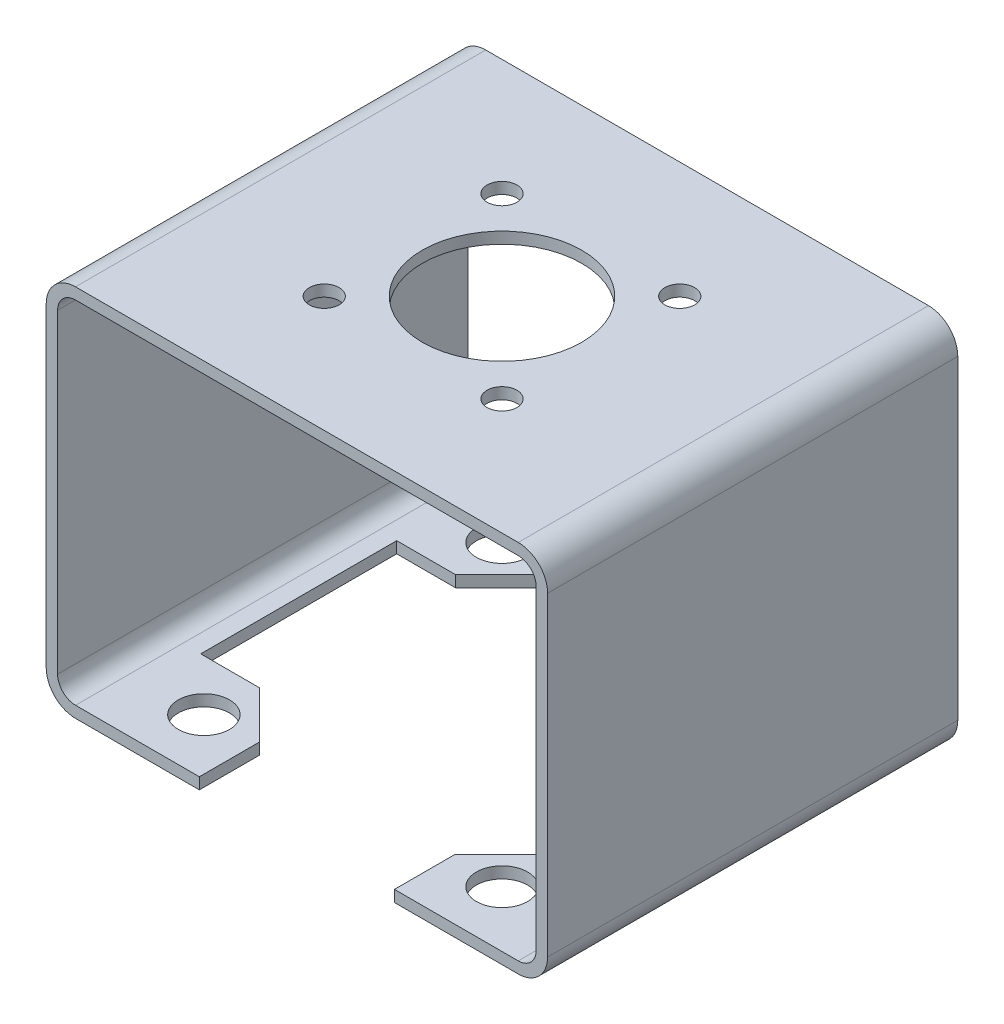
ISO-10303-21;
HEADER;
FILE_DESCRIPTION(('STEP AP214'),'2;1');
FILE_NAME('part.step','',(''),(''),'','','');
FILE_SCHEMA(('AUTOMOTIVE_DESIGN { 1 0 10303 214 1 1 1 1 }'));
ENDSEC;
DATA;
#1=APPLICATION_CONTEXT('core data for automotive mechanical design processes');
#2=APPLICATION_PROTOCOL_DEFINITION('international standard','automotive_design',2000,#1);
#3=PRODUCT_CONTEXT('',#1,'mechanical');
#4=PRODUCT('Part','Part','',(#3));
#5=PRODUCT_RELATED_PRODUCT_CATEGORY('part','',(#4));
#6=PRODUCT_DEFINITION_FORMATION('','',#4);
#7=PRODUCT_DEFINITION_CONTEXT('part definition',#1,'design');
#8=PRODUCT_DEFINITION('design','',#6,#7);
#9=PRODUCT_DEFINITION_SHAPE('','',#8);
#10=(LENGTH_UNIT() NAMED_UNIT(*) SI_UNIT(.MILLI.,.METRE.));
#11=(NAMED_UNIT(*) PLANE_ANGLE_UNIT() SI_UNIT($,.RADIAN.));
#12=(NAMED_UNIT(*) SI_UNIT($,.STERADIAN.) SOLID_ANGLE_UNIT());
#13=UNCERTAINTY_MEASURE_WITH_UNIT(LENGTH_MEASURE(1.E-05),#10,'distance_accuracy_value','');
#14=(GEOMETRIC_REPRESENTATION_CONTEXT(3) GLOBAL_UNCERTAINTY_ASSIGNED_CONTEXT((#13)) GLOBAL_UNIT_ASSIGNED_CONTEXT((#10,
#11,#12)) REPRESENTATION_CONTEXT('',''));
#15=CARTESIAN_POINT('',(0.,0.,0.));
#16=DIRECTION('',(0.,0.,1.));
#17=DIRECTION('',(1.,0.,0.));
#18=AXIS2_PLACEMENT_3D('',#15,#16,#17);
#19=CARTESIAN_POINT('',(27.178,0.,114.3));
#20=DIRECTION('',(-1.,0.,0.));
#21=DIRECTION('',(0.,0.,1.));
#22=AXIS2_PLACEMENT_3D('',#19,#20,#21);
#23=PLANE('',#22);
#24=DIRECTION('',(0.,-1.,0.));
#25=VECTOR('',#24,1.);
#26=CARTESIAN_POINT('',(27.178,104.141,16.764));
#27=LINE('',#26,#25);
#28=CARTESIAN_POINT('',(27.178,3.17500000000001,16.764));
#29=VERTEX_POINT('',#28);
#30=CARTESIAN_POINT('',(27.178,0.,16.764));
#31=VERTEX_POINT('',#30);
#32=EDGE_CURVE('E259',#29,#31,#27,.T.);
#33=ORIENTED_EDGE('',*,*,#32,.F.);
#34=DIRECTION('',(0.,0.,-1.));
#35=VECTOR('',#34,1.);
#36=CARTESIAN_POINT('',(27.178,3.17500000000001,114.3));
#37=LINE('',#36,#35);
#38=CARTESIAN_POINT('',(27.178,3.17500000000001,0.));
#39=VERTEX_POINT('',#38);
#40=EDGE_CURVE('E266',#29,#39,#37,.T.);
#41=ORIENTED_EDGE('',*,*,#40,.T.);
#42=DIRECTION('',(0.,1.,0.));
#43=VECTOR('',#42,1.);
#44=CARTESIAN_POINT('',(27.178,0.,0.));
#45=LINE('',#44,#43);
#46=CARTESIAN_POINT('',(27.178,0.,0.));
#47=VERTEX_POINT('',#46);
#48=EDGE_CURVE('E342',#47,#39,#45,.T.);
#49=ORIENTED_EDGE('',*,*,#48,.F.);
#50=DIRECTION('',(0.,0.,-1.));
#51=VECTOR('',#50,1.);
#52=CARTESIAN_POINT('',(27.178,0.,114.3));
#53=LINE('',#52,#51);
#54=EDGE_CURVE('E385',#31,#47,#53,.T.);
#55=ORIENTED_EDGE('',*,*,#54,.F.);
#56=EDGE_LOOP('',(#33,#41,#49,#55));
#57=FACE_BOUND('',#56,.T.);
#58=ADVANCED_FACE('F30',(#57),#23,.T.);
#59=CARTESIAN_POINT('',(-27.178,3.175,114.3));
#60=DIRECTION('',(1.,0.,0.));
#61=DIRECTION('',(0.,0.,-1.));
#62=AXIS2_PLACEMENT_3D('',#59,#60,#61);
#63=PLANE('',#62);
#64=DIRECTION('',(0.,-1.,0.));
#65=VECTOR('',#64,1.);
#66=CARTESIAN_POINT('',(-27.178,104.141,16.764));
#67=LINE('',#66,#65);
#68=CARTESIAN_POINT('',(-27.178,3.175,16.764));
#69=VERTEX_POINT('',#68);
#70=CARTESIAN_POINT('',(-27.178,0.,16.764));
#71=VERTEX_POINT('',#70);
#72=EDGE_CURVE('E507',#69,#71,#67,.T.);
#73=ORIENTED_EDGE('',*,*,#72,.T.);
#74=DIRECTION('',(0.,0.,-1.));
#75=VECTOR('',#74,1.);
#76=CARTESIAN_POINT('',(-27.178,0.,114.3));
#77=LINE('',#76,#75);
#78=CARTESIAN_POINT('',(-27.178,0.,0.));
#79=VERTEX_POINT('',#78);
#80=EDGE_CURVE('E38',#71,#79,#77,.T.);
#81=ORIENTED_EDGE('',*,*,#80,.T.);
#82=DIRECTION('',(0.,-1.,0.));
#83=VECTOR('',#82,1.);
#84=CARTESIAN_POINT('',(-27.178,3.175,0.));
#85=LINE('',#84,#83);
#86=CARTESIAN_POINT('',(-27.178,3.175,0.));
#87=VERTEX_POINT('',#86);
#88=EDGE_CURVE('E306',#87,#79,#85,.T.);
#89=ORIENTED_EDGE('',*,*,#88,.F.);
#90=DIRECTION('',(0.,0.,-1.));
#91=VECTOR('',#90,1.);
#92=CARTESIAN_POINT('',(-27.178,3.175,114.3));
#93=LINE('',#92,#91);
#94=EDGE_CURVE('E286',#69,#87,#93,.T.);
#95=ORIENTED_EDGE('',*,*,#94,.F.);
#96=EDGE_LOOP('',(#73,#81,#89,#95));
#97=FACE_BOUND('',#96,.T.);
#98=ADVANCED_FACE('F307',(#97),#63,.T.);
#99=CARTESIAN_POINT('',(-27.178,0.,114.3));
#100=DIRECTION('',(0.,1.,0.));
#101=DIRECTION('',(-1.,0.,0.));
#102=AXIS2_PLACEMENT_3D('',#99,#100,#101);
#103=PLANE('',#102);
#104=CARTESIAN_POINT('',(-41.529,0.,15.621));
#105=DIRECTION('',(0.,-1.,0.));
#106=DIRECTION('',(1.,0.,0.));
#107=AXIS2_PLACEMENT_3D('',#104,#105,#106);
#108=CIRCLE('',#107,7.1374);
#109=CARTESIAN_POINT('',(-34.3916,0.,15.621));
#110=VERTEX_POINT('',#109);
#111=EDGE_CURVE('E564',#110,#110,#108,.T.);
#112=ORIENTED_EDGE('',*,*,#111,.F.);
#113=EDGE_LOOP('',(#112));
#114=FACE_BOUND('',#113,.T.);
#115=CARTESIAN_POINT('',(-41.529,0.,98.679));
#116=DIRECTION('',(0.,-1.,0.));
#117=DIRECTION('',(1.,0.,0.));
#118=AXIS2_PLACEMENT_3D('',#115,#116,#117);
#119=CIRCLE('',#118,7.1374);
#120=CARTESIAN_POINT('',(-34.3916,0.,98.679));
#121=VERTEX_POINT('',#120);
#122=EDGE_CURVE('E420',#121,#121,#119,.T.);
#123=ORIENTED_EDGE('',*,*,#122,.F.);
#124=EDGE_LOOP('',(#123));
#125=FACE_BOUND('',#124,.T.);
#126=ORIENTED_EDGE('',*,*,#80,.F.);
#127=DIRECTION('',(0.707106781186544,0.,-0.707106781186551));
#128=VECTOR('',#127,1.);
#129=CARTESIAN_POINT('',(-27.178,0.,16.764));
#130=LINE('',#129,#128);
#131=CARTESIAN_POINT('',(-40.2589999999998,0.,29.845));
#132=VERTEX_POINT('',#131);
#133=EDGE_CURVE('E492',#132,#71,#130,.T.);
#134=ORIENTED_EDGE('',*,*,#133,.F.);
#135=DIRECTION('',(1.,0.,0.));
#136=VECTOR('',#135,1.);
#137=CARTESIAN_POINT('',(-56.642,0.,29.845));
#138=LINE('',#137,#136);
#139=CARTESIAN_POINT('',(-56.642,0.,29.845));
#140=VERTEX_POINT('',#139);
#141=EDGE_CURVE('E495',#140,#132,#138,.T.);
#142=ORIENTED_EDGE('',*,*,#141,.F.);
#143=DIRECTION('',(0.,0.,-1.));
#144=VECTOR('',#143,1.);
#145=CARTESIAN_POINT('',(-56.642,0.,84.455));
#146=LINE('',#145,#144);
#147=CARTESIAN_POINT('',(-56.642,0.,84.455));
#148=VERTEX_POINT('',#147);
#149=EDGE_CURVE('E498',#148,#140,#146,.T.);
#150=ORIENTED_EDGE('',*,*,#149,.F.);
#151=DIRECTION('',(-1.,0.,0.));
#152=VECTOR('',#151,1.);
#153=CARTESIAN_POINT('',(-40.259,0.,84.455));
#154=LINE('',#153,#152);
#155=CARTESIAN_POINT('',(-40.259,0.,84.455));
#156=VERTEX_POINT('',#155);
#157=EDGE_CURVE('E501',#156,#148,#154,.T.);
#158=ORIENTED_EDGE('',*,*,#157,.F.);
#159=DIRECTION('',(-0.707106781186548,0.,-0.707106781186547));
#160=VECTOR('',#159,1.);
#161=CARTESIAN_POINT('',(-27.178,0.,97.536));
#162=LINE('',#161,#160);
#163=CARTESIAN_POINT('',(-27.178,0.,97.536));
#164=VERTEX_POINT('',#163);
#165=EDGE_CURVE('E504',#164,#156,#162,.T.);
#166=ORIENTED_EDGE('',*,*,#165,.F.);
#167=CARTESIAN_POINT('',(-27.178,0.,114.3));
#168=VERTEX_POINT('',#167);
#169=EDGE_CURVE('E11',#168,#164,#77,.T.);
#170=ORIENTED_EDGE('',*,*,#169,.F.);
#171=DIRECTION('',(1.,0.,0.));
#172=VECTOR('',#171,1.);
#173=CARTESIAN_POINT('',(-27.178,0.,114.3));
#174=LINE('',#173,#172);
#175=CARTESIAN_POINT('',(-61.675,0.,114.3));
#176=VERTEX_POINT('',#175);
#177=EDGE_CURVE('E361',#176,#168,#174,.T.);
#178=ORIENTED_EDGE('',*,*,#177,.F.);
#179=DIRECTION('',(0.,0.,-1.));
#180=VECTOR('',#179,1.);
#181=CARTESIAN_POINT('',(-61.675,0.,114.3));
#182=LINE('',#181,#180);
#183=CARTESIAN_POINT('',(-61.675,0.,0.));
#184=VERTEX_POINT('',#183);
#185=EDGE_CURVE('E362',#176,#184,#182,.T.);
#186=ORIENTED_EDGE('',*,*,#185,.T.);
#187=DIRECTION('',(1.,0.,0.));
#188=VECTOR('',#187,1.);
#189=CARTESIAN_POINT('',(-27.178,0.,0.));
#190=LINE('',#189,#188);
#191=EDGE_CURVE('E312',#184,#79,#190,.T.);
#192=ORIENTED_EDGE('',*,*,#191,.T.);
#193=EDGE_LOOP('',(#126,#134,#142,#150,#158,#166,#170,#178,#186,#192));
#194=FACE_BOUND('',#193,.T.);
#195=ADVANCED_FACE('F32',(#114,#125,#194),#103,.F.);
#196=DIRECTION('',(0.,-1.,0.));
#197=VECTOR('',#196,1.);
#198=CARTESIAN_POINT('',(-27.178,104.141,97.536));
#199=LINE('',#198,#197);
#200=CARTESIAN_POINT('',(-27.178,3.175,97.536));
#201=VERTEX_POINT('',#200);
#202=EDGE_CURVE('E508',#201,#164,#199,.T.);
#203=ORIENTED_EDGE('',*,*,#202,.F.);
#204=CARTESIAN_POINT('',(-27.178,3.175,114.3));
#205=VERTEX_POINT('',#204);
#206=EDGE_CURVE('E287',#205,#201,#93,.T.);
#207=ORIENTED_EDGE('',*,*,#206,.F.);
#208=DIRECTION('',(0.,-1.,0.));
#209=VECTOR('',#208,1.);
#210=CARTESIAN_POINT('',(-27.178,3.175,114.3));
#211=LINE('',#210,#209);
#212=EDGE_CURVE('E433',#205,#168,#211,.T.);
#213=ORIENTED_EDGE('',*,*,#212,.T.);
#214=ORIENTED_EDGE('',*,*,#169,.T.);
#215=EDGE_LOOP('',(#203,#207,#213,#214));
#216=FACE_BOUND('',#215,.T.);
#217=ADVANCED_FACE('F590',(#216),#63,.T.);
#218=CARTESIAN_POINT('',(-27.178,3.175,114.3));
#219=DIRECTION('',(0.,1.,0.));
#220=DIRECTION('',(-1.,0.,0.));
#221=AXIS2_PLACEMENT_3D('',#218,#219,#220);
#222=PLANE('',#221);
#223=DIRECTION('',(0.707106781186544,0.,-0.707106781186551));
#224=VECTOR('',#223,1.);
#225=CARTESIAN_POINT('',(-27.178,3.175,16.764));
#226=LINE('',#225,#224);
#227=CARTESIAN_POINT('',(-40.2589999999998,3.175,29.845));
#228=VERTEX_POINT('',#227);
#229=EDGE_CURVE('E302',#228,#69,#226,.T.);
#230=ORIENTED_EDGE('',*,*,#229,.T.);
#231=ORIENTED_EDGE('',*,*,#94,.T.);
#232=DIRECTION('',(1.,0.,0.));
#233=VECTOR('',#232,1.);
#234=CARTESIAN_POINT('',(-27.178,3.175,0.));
#235=LINE('',#234,#233);
#236=CARTESIAN_POINT('',(-61.675,3.175,0.));
#237=VERTEX_POINT('',#236);
#238=EDGE_CURVE('E299',#237,#87,#235,.T.);
#239=ORIENTED_EDGE('',*,*,#238,.F.);
#240=DIRECTION('',(0.,0.,-1.));
#241=VECTOR('',#240,1.);
#242=CARTESIAN_POINT('',(-61.675,3.175,114.3));
#243=LINE('',#242,#241);
#244=CARTESIAN_POINT('',(-61.675,3.175,114.3));
#245=VERTEX_POINT('',#244);
#246=EDGE_CURVE('E285',#245,#237,#243,.T.);
#247=ORIENTED_EDGE('',*,*,#246,.F.);
#248=DIRECTION('',(1.,0.,0.));
#249=VECTOR('',#248,1.);
#250=CARTESIAN_POINT('',(-27.178,3.175,114.3));
#251=LINE('',#250,#249);
#252=EDGE_CURVE('E436',#245,#205,#251,.T.);
#253=ORIENTED_EDGE('',*,*,#252,.T.);
#254=ORIENTED_EDGE('',*,*,#206,.T.);
#255=DIRECTION('',(-0.707106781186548,0.,-0.707106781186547));
#256=VECTOR('',#255,1.);
#257=CARTESIAN_POINT('',(-27.178,3.175,97.536));
#258=LINE('',#257,#256);
#259=CARTESIAN_POINT('',(-40.259,3.175,84.455));
#260=VERTEX_POINT('',#259);
#261=EDGE_CURVE('E489',#201,#260,#258,.T.);
#262=ORIENTED_EDGE('',*,*,#261,.T.);
#263=DIRECTION('',(-1.,0.,0.));
#264=VECTOR('',#263,1.);
#265=CARTESIAN_POINT('',(-40.259,3.175,84.455));
#266=LINE('',#265,#264);
#267=CARTESIAN_POINT('',(-56.642,3.175,84.455));
#268=VERTEX_POINT('',#267);
#269=EDGE_CURVE('E516',#260,#268,#266,.T.);
#270=ORIENTED_EDGE('',*,*,#269,.T.);
#271=DIRECTION('',(0.,0.,-1.));
#272=VECTOR('',#271,1.);
#273=CARTESIAN_POINT('',(-56.642,3.175,84.455));
#274=LINE('',#273,#272);
#275=CARTESIAN_POINT('',(-56.642,3.175,29.845));
#276=VERTEX_POINT('',#275);
#277=EDGE_CURVE('E512',#268,#276,#274,.T.);
#278=ORIENTED_EDGE('',*,*,#277,.T.);
#279=DIRECTION('',(1.,0.,0.));
#280=VECTOR('',#279,1.);
#281=CARTESIAN_POINT('',(-56.642,3.175,29.845));
#282=LINE('',#281,#280);
#283=EDGE_CURVE('E509',#276,#228,#282,.T.);
#284=ORIENTED_EDGE('',*,*,#283,.T.);
#285=EDGE_LOOP('',(#230,#231,#239,#247,#253,#254,#262,#270,#278,#284));
#286=FACE_BOUND('',#285,.T.);
#287=CARTESIAN_POINT('',(-41.529,3.175,15.621));
#288=DIRECTION('',(0.,1.,0.));
#289=DIRECTION('',(-1.,0.,0.));
#290=AXIS2_PLACEMENT_3D('',#287,#288,#289);
#291=CIRCLE('',#290,7.1374);
#292=CARTESIAN_POINT('',(-48.6664,3.175,15.621));
#293=VERTEX_POINT('',#292);
#294=EDGE_CURVE('E561',#293,#293,#291,.F.);
#295=ORIENTED_EDGE('',*,*,#294,.T.);
#296=EDGE_LOOP('',(#295));
#297=FACE_BOUND('',#296,.T.);
#298=CARTESIAN_POINT('',(-41.529,3.175,98.679));
#299=DIRECTION('',(0.,1.,0.));
#300=DIRECTION('',(-1.,0.,0.));
#301=AXIS2_PLACEMENT_3D('',#298,#299,#300);
#302=CIRCLE('',#301,7.1374);
#303=CARTESIAN_POINT('',(-48.6664,3.175,98.679));
#304=VERTEX_POINT('',#303);
#305=EDGE_CURVE('E423',#304,#304,#302,.F.);
#306=ORIENTED_EDGE('',*,*,#305,.T.);
#307=EDGE_LOOP('',(#306));
#308=FACE_BOUND('',#307,.T.);
#309=ADVANCED_FACE('F296',(#286,#297,#308),#222,.T.);
#310=CARTESIAN_POINT('',(-61.675,8.175,114.3));
#311=DIRECTION('',(0.,0.,-1.));
#312=DIRECTION('',(-1.,0.,0.));
#313=AXIS2_PLACEMENT_3D('',#310,#311,#312);
#314=CYLINDRICAL_SURFACE('',#313,5.);
#315=CARTESIAN_POINT('',(-61.675,8.175,0.));
#316=DIRECTION('',(0.,0.,1.));
#317=DIRECTION('',(1.,0.,0.));
#318=AXIS2_PLACEMENT_3D('',#315,#316,#317);
#319=CIRCLE('',#318,5.);
#320=CARTESIAN_POINT('',(-66.675,8.175,0.));
#321=VERTEX_POINT('',#320);
#322=EDGE_CURVE('E317',#321,#237,#319,.T.);
#323=ORIENTED_EDGE('',*,*,#322,.F.);
#324=DIRECTION('',(0.,0.,-1.));
#325=VECTOR('',#324,1.);
#326=CARTESIAN_POINT('',(-66.675,8.175,114.3));
#327=LINE('',#326,#325);
#328=CARTESIAN_POINT('',(-66.675,8.175,114.3));
#329=VERTEX_POINT('',#328);
#330=EDGE_CURVE('E283',#329,#321,#327,.T.);
#331=ORIENTED_EDGE('',*,*,#330,.F.);
#332=CARTESIAN_POINT('',(-61.675,8.175,114.3));
#333=DIRECTION('',(0.,0.,1.));
#334=DIRECTION('',(1.,0.,0.));
#335=AXIS2_PLACEMENT_3D('',#332,#333,#334);
#336=CIRCLE('',#335,5.);
#337=EDGE_CURVE('E438',#329,#245,#336,.T.);
#338=ORIENTED_EDGE('',*,*,#337,.T.);
#339=ORIENTED_EDGE('',*,*,#246,.T.);
#340=EDGE_LOOP('',(#323,#331,#338,#339));
#341=FACE_BOUND('',#340,.T.);
#342=ADVANCED_FACE('F615',(#341),#314,.F.);
#343=CARTESIAN_POINT('',(-66.675,8.175,114.3));
#344=DIRECTION('',(1.,0.,0.));
#345=DIRECTION('',(0.,0.,-1.));
#346=AXIS2_PLACEMENT_3D('',#343,#344,#345);
#347=PLANE('',#346);
#348=DIRECTION('',(0.,1.,0.));
#349=VECTOR('',#348,1.);
#350=CARTESIAN_POINT('',(-66.675,8.175,0.));
#351=LINE('',#350,#349);
#352=CARTESIAN_POINT('',(-66.675,95.965,0.));
#353=VERTEX_POINT('',#352);
#354=EDGE_CURVE('E319',#353,#321,#351,.F.);
#355=ORIENTED_EDGE('',*,*,#354,.F.);
#356=DIRECTION('',(0.,0.,-1.));
#357=VECTOR('',#356,1.);
#358=CARTESIAN_POINT('',(-66.675,95.965,114.3));
#359=LINE('',#358,#357);
#360=CARTESIAN_POINT('',(-66.675,95.965,114.3));
#361=VERTEX_POINT('',#360);
#362=EDGE_CURVE('E281',#361,#353,#359,.T.);
#363=ORIENTED_EDGE('',*,*,#362,.F.);
#364=DIRECTION('',(0.,1.,0.));
#365=VECTOR('',#364,1.);
#366=CARTESIAN_POINT('',(-66.675,8.175,114.3));
#367=LINE('',#366,#365);
#368=EDGE_CURVE('E441',#361,#329,#367,.F.);
#369=ORIENTED_EDGE('',*,*,#368,.T.);
#370=ORIENTED_EDGE('',*,*,#330,.T.);
#371=EDGE_LOOP('',(#355,#363,#369,#370));
#372=FACE_BOUND('',#371,.T.);
#373=ADVANCED_FACE('F611',(#372),#347,.T.);
#374=CARTESIAN_POINT('',(-61.675,95.965,114.3));
#375=DIRECTION('',(0.,0.,-1.));
#376=DIRECTION('',(-1.,0.,0.));
#377=AXIS2_PLACEMENT_3D('',#374,#375,#376);
#378=CYLINDRICAL_SURFACE('',#377,5.);
#379=CARTESIAN_POINT('',(-61.675,95.965,0.));
#380=DIRECTION('',(0.,0.,1.));
#381=DIRECTION('',(1.,0.,0.));
#382=AXIS2_PLACEMENT_3D('',#379,#380,#381);
#383=CIRCLE('',#382,5.);
#384=CARTESIAN_POINT('',(-61.675,100.965,0.));
#385=VERTEX_POINT('',#384);
#386=EDGE_CURVE('E324',#385,#353,#383,.T.);
#387=ORIENTED_EDGE('',*,*,#386,.F.);
#388=DIRECTION('',(0.,0.,-1.));
#389=VECTOR('',#388,1.);
#390=CARTESIAN_POINT('',(-61.675,100.965,114.3));
#391=LINE('',#390,#389);
#392=CARTESIAN_POINT('',(-61.675,100.965,114.3));
#393=VERTEX_POINT('',#392);
#394=EDGE_CURVE('E279',#393,#385,#391,.T.);
#395=ORIENTED_EDGE('',*,*,#394,.F.);
#396=CARTESIAN_POINT('',(-61.675,95.965,114.3));
#397=DIRECTION('',(0.,0.,1.));
#398=DIRECTION('',(1.,0.,0.));
#399=AXIS2_PLACEMENT_3D('',#396,#397,#398);
#400=CIRCLE('',#399,5.);
#401=EDGE_CURVE('E444',#393,#361,#400,.T.);
#402=ORIENTED_EDGE('',*,*,#401,.T.);
#403=ORIENTED_EDGE('',*,*,#362,.T.);
#404=EDGE_LOOP('',(#387,#395,#402,#403));
#405=FACE_BOUND('',#404,.T.);
#406=ADVANCED_FACE('F607',(#405),#378,.F.);
#407=CARTESIAN_POINT('',(-61.675,100.965,114.3));
#408=DIRECTION('',(0.,-1.,0.));
#409=DIRECTION('',(0.,0.,-1.));
#410=AXIS2_PLACEMENT_3D('',#407,#408,#409);
#411=PLANE('',#410);
#412=CARTESIAN_POINT('',(-24.764999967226,100.965,81.915));
#413=DIRECTION('',(0.,-1.,0.));
#414=DIRECTION('',(0.,0.,-1.));
#415=AXIS2_PLACEMENT_3D('',#412,#413,#414);
#416=CIRCLE('',#415,4.16560000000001);
#417=CARTESIAN_POINT('',(-24.764999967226,100.965,77.7494));
#418=VERTEX_POINT('',#417);
#419=EDGE_CURVE('E494',#418,#418,#416,.T.);
#420=ORIENTED_EDGE('',*,*,#419,.F.);
#421=EDGE_LOOP('',(#420));
#422=FACE_BOUND('',#421,.T.);
#423=CARTESIAN_POINT('',(-24.765,100.965,32.385));
#424=DIRECTION('',(0.,-1.,0.));
#425=DIRECTION('',(0.,0.,-1.));
#426=AXIS2_PLACEMENT_3D('',#423,#424,#425);
#427=CIRCLE('',#426,4.1656);
#428=CARTESIAN_POINT('',(-24.765,100.965,28.2194));
#429=VERTEX_POINT('',#428);
#430=EDGE_CURVE('E529',#429,#429,#427,.T.);
#431=ORIENTED_EDGE('',*,*,#430,.F.);
#432=EDGE_LOOP('',(#431));
#433=FACE_BOUND('',#432,.T.);
#434=CARTESIAN_POINT('',(24.765,100.965,32.385));
#435=DIRECTION('',(0.,-1.,0.));
#436=DIRECTION('',(0.,0.,-1.));
#437=AXIS2_PLACEMENT_3D('',#434,#435,#436);
#438=CIRCLE('',#437,4.1656);
#439=CARTESIAN_POINT('',(24.765,100.965,28.2194));
#440=VERTEX_POINT('',#439);
#441=EDGE_CURVE('E535',#440,#440,#438,.T.);
#442=ORIENTED_EDGE('',*,*,#441,.F.);
#443=EDGE_LOOP('',(#442));
#444=FACE_BOUND('',#443,.T.);
#445=CARTESIAN_POINT('',(24.765,100.965,81.915));
#446=DIRECTION('',(0.,-1.,0.));
#447=DIRECTION('',(0.,0.,-1.));
#448=AXIS2_PLACEMENT_3D('',#445,#446,#447);
#449=CIRCLE('',#448,4.1656);
#450=CARTESIAN_POINT('',(24.765,100.965,77.7494));
#451=VERTEX_POINT('',#450);
#452=EDGE_CURVE('E541',#451,#451,#449,.T.);
#453=ORIENTED_EDGE('',*,*,#452,.F.);
#454=EDGE_LOOP('',(#453));
#455=FACE_BOUND('',#454,.T.);
#456=CARTESIAN_POINT('',(0.,100.965,57.15));
#457=DIRECTION('',(0.,-1.,0.));
#458=DIRECTION('',(0.,0.,-1.));
#459=AXIS2_PLACEMENT_3D('',#456,#457,#458);
#460=CIRCLE('',#459,22.225);
#461=CARTESIAN_POINT('',(0.,100.965,34.925));
#462=VERTEX_POINT('',#461);
#463=EDGE_CURVE('E547',#462,#462,#460,.T.);
#464=ORIENTED_EDGE('',*,*,#463,.F.);
#465=EDGE_LOOP('',(#464));
#466=FACE_BOUND('',#465,.T.);
#467=DIRECTION('',(1.,0.,0.));
#468=VECTOR('',#467,1.);
#469=CARTESIAN_POINT('',(-61.675,100.965,0.));
#470=LINE('',#469,#468);
#471=CARTESIAN_POINT('',(61.675,100.965,0.));
#472=VERTEX_POINT('',#471);
#473=EDGE_CURVE('E327',#472,#385,#470,.F.);
#474=ORIENTED_EDGE('',*,*,#473,.F.);
#475=DIRECTION('',(0.,0.,-1.));
#476=VECTOR('',#475,1.);
#477=CARTESIAN_POINT('',(61.675,100.965,114.3));
#478=LINE('',#477,#476);
#479=CARTESIAN_POINT('',(61.675,100.965,114.3));
#480=VERTEX_POINT('',#479);
#481=EDGE_CURVE('E277',#480,#472,#478,.T.);
#482=ORIENTED_EDGE('',*,*,#481,.F.);
#483=DIRECTION('',(1.,0.,0.));
#484=VECTOR('',#483,1.);
#485=CARTESIAN_POINT('',(-61.675,100.965,114.3));
#486=LINE('',#485,#484);
#487=EDGE_CURVE('E447',#480,#393,#486,.F.);
#488=ORIENTED_EDGE('',*,*,#487,.T.);
#489=ORIENTED_EDGE('',*,*,#394,.T.);
#490=EDGE_LOOP('',(#474,#482,#488,#489));
#491=FACE_BOUND('',#490,.T.);
#492=ADVANCED_FACE('F603',(#422,#433,#444,#455,#466,#491),#411,.T.);
#493=CARTESIAN_POINT('',(61.675,95.965,114.3));
#494=DIRECTION('',(0.,0.,-1.));
#495=DIRECTION('',(-1.,0.,0.));
#496=AXIS2_PLACEMENT_3D('',#493,#494,#495);
#497=CYLINDRICAL_SURFACE('',#496,4.99999999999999);
#498=CARTESIAN_POINT('',(61.675,95.965,0.));
#499=DIRECTION('',(0.,0.,1.));
#500=DIRECTION('',(1.,0.,0.));
#501=AXIS2_PLACEMENT_3D('',#498,#499,#500);
#502=CIRCLE('',#501,4.99999999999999);
#503=CARTESIAN_POINT('',(66.675,95.965,0.));
#504=VERTEX_POINT('',#503);
#505=EDGE_CURVE('E330',#504,#472,#502,.T.);
#506=ORIENTED_EDGE('',*,*,#505,.F.);
#507=DIRECTION('',(0.,0.,-1.));
#508=VECTOR('',#507,1.);
#509=CARTESIAN_POINT('',(66.675,95.965,114.3));
#510=LINE('',#509,#508);
#511=CARTESIAN_POINT('',(66.675,95.965,114.3));
#512=VERTEX_POINT('',#511);
#513=EDGE_CURVE('E275',#512,#504,#510,.T.);
#514=ORIENTED_EDGE('',*,*,#513,.F.);
#515=CARTESIAN_POINT('',(61.675,95.965,114.3));
#516=DIRECTION('',(0.,0.,1.));
#517=DIRECTION('',(1.,0.,0.));
#518=AXIS2_PLACEMENT_3D('',#515,#516,#517);
#519=CIRCLE('',#518,4.99999999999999);
#520=EDGE_CURVE('E450',#512,#480,#519,.T.);
#521=ORIENTED_EDGE('',*,*,#520,.T.);
#522=ORIENTED_EDGE('',*,*,#481,.T.);
#523=EDGE_LOOP('',(#506,#514,#521,#522));
#524=FACE_BOUND('',#523,.T.);
#525=ADVANCED_FACE('F599',(#524),#497,.F.);
#526=CARTESIAN_POINT('',(66.675,8.17500000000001,114.3));
#527=DIRECTION('',(-1.,0.,0.));
#528=DIRECTION('',(0.,0.,1.));
#529=AXIS2_PLACEMENT_3D('',#526,#527,#528);
#530=PLANE('',#529);
#531=DIRECTION('',(0.,1.,0.));
#532=VECTOR('',#531,1.);
#533=CARTESIAN_POINT('',(66.675,8.17500000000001,0.));
#534=LINE('',#533,#532);
#535=CARTESIAN_POINT('',(66.675,8.17500000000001,0.));
#536=VERTEX_POINT('',#535);
#537=EDGE_CURVE('E333',#536,#504,#534,.T.);
#538=ORIENTED_EDGE('',*,*,#537,.F.);
#539=DIRECTION('',(0.,0.,-1.));
#540=VECTOR('',#539,1.);
#541=CARTESIAN_POINT('',(66.675,8.17500000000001,114.3));
#542=LINE('',#541,#540);
#543=CARTESIAN_POINT('',(66.675,8.17500000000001,114.3));
#544=VERTEX_POINT('',#543);
#545=EDGE_CURVE('E268',#544,#536,#542,.T.);
#546=ORIENTED_EDGE('',*,*,#545,.F.);
#547=DIRECTION('',(0.,1.,0.));
#548=VECTOR('',#547,1.);
#549=CARTESIAN_POINT('',(66.675,8.17500000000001,114.3));
#550=LINE('',#549,#548);
#551=EDGE_CURVE('E453',#544,#512,#550,.T.);
#552=ORIENTED_EDGE('',*,*,#551,.T.);
#553=ORIENTED_EDGE('',*,*,#513,.T.);
#554=EDGE_LOOP('',(#538,#546,#552,#553));
#555=FACE_BOUND('',#554,.T.);
#556=ADVANCED_FACE('F596',(#555),#530,.T.);
#557=CARTESIAN_POINT('',(61.675,8.17500000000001,114.3));
#558=DIRECTION('',(0.,0.,-1.));
#559=DIRECTION('',(-1.,0.,0.));
#560=AXIS2_PLACEMENT_3D('',#557,#558,#559);
#561=CYLINDRICAL_SURFACE('',#560,5.00000000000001);
#562=CARTESIAN_POINT('',(61.675,8.17500000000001,0.));
#563=DIRECTION('',(0.,0.,1.));
#564=DIRECTION('',(1.,0.,0.));
#565=AXIS2_PLACEMENT_3D('',#562,#563,#564);
#566=CIRCLE('',#565,5.00000000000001);
#567=CARTESIAN_POINT('',(61.675,3.17500000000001,0.));
#568=VERTEX_POINT('',#567);
#569=EDGE_CURVE('E336',#568,#536,#566,.T.);
#570=ORIENTED_EDGE('',*,*,#569,.F.);
#571=DIRECTION('',(0.,0.,-1.));
#572=VECTOR('',#571,1.);
#573=CARTESIAN_POINT('',(61.675,3.17500000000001,114.3));
#574=LINE('',#573,#572);
#575=CARTESIAN_POINT('',(61.675,3.17500000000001,114.3));
#576=VERTEX_POINT('',#575);
#577=EDGE_CURVE('E265',#576,#568,#574,.T.);
#578=ORIENTED_EDGE('',*,*,#577,.F.);
#579=CARTESIAN_POINT('',(61.675,8.17500000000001,114.3));
#580=DIRECTION('',(0.,0.,1.));
#581=DIRECTION('',(1.,0.,0.));
#582=AXIS2_PLACEMENT_3D('',#579,#580,#581);
#583=CIRCLE('',#582,5.00000000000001);
#584=EDGE_CURVE('E405',#576,#544,#583,.T.);
#585=ORIENTED_EDGE('',*,*,#584,.T.);
#586=ORIENTED_EDGE('',*,*,#545,.T.);
#587=EDGE_LOOP('',(#570,#578,#585,#586));
#588=FACE_BOUND('',#587,.T.);
#589=ADVANCED_FACE('F458',(#588),#561,.F.);
#590=CARTESIAN_POINT('',(27.178,3.17500000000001,114.3));
#591=DIRECTION('',(0.,1.,0.));
#592=DIRECTION('',(-1.,0.,0.));
#593=AXIS2_PLACEMENT_3D('',#590,#591,#592);
#594=PLANE('',#593);
#595=DIRECTION('',(0.707106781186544,0.,0.707106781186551));
#596=VECTOR('',#595,1.);
#597=CARTESIAN_POINT('',(27.178,3.17500000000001,16.764));
#598=LINE('',#597,#596);
#599=CARTESIAN_POINT('',(40.2589999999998,3.17500000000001,29.845));
#600=VERTEX_POINT('',#599);
#601=EDGE_CURVE('E468',#29,#600,#598,.T.);
#602=ORIENTED_EDGE('',*,*,#601,.T.);
#603=DIRECTION('',(1.,0.,0.));
#604=VECTOR('',#603,1.);
#605=CARTESIAN_POINT('',(56.642,3.17500000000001,29.845));
#606=LINE('',#605,#604);
#607=CARTESIAN_POINT('',(56.642,3.17500000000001,29.845));
#608=VERTEX_POINT('',#607);
#609=EDGE_CURVE('E469',#600,#608,#606,.T.);
#610=ORIENTED_EDGE('',*,*,#609,.T.);
#611=DIRECTION('',(0.,0.,1.));
#612=VECTOR('',#611,1.);
#613=CARTESIAN_POINT('',(56.642,3.17500000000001,84.455));
#614=LINE('',#613,#612);
#615=CARTESIAN_POINT('',(56.642,3.17500000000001,84.455));
#616=VERTEX_POINT('',#615);
#617=EDGE_CURVE('E482',#608,#616,#614,.T.);
#618=ORIENTED_EDGE('',*,*,#617,.T.);
#619=DIRECTION('',(-1.,0.,0.));
#620=VECTOR('',#619,1.);
#621=CARTESIAN_POINT('',(40.259,3.17500000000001,84.455));
#622=LINE('',#621,#620);
#623=CARTESIAN_POINT('',(40.259,3.17500000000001,84.455));
#624=VERTEX_POINT('',#623);
#625=EDGE_CURVE('E258',#616,#624,#622,.T.);
#626=ORIENTED_EDGE('',*,*,#625,.T.);
#627=DIRECTION('',(-0.707106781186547,0.,0.707106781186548));
#628=VECTOR('',#627,1.);
#629=CARTESIAN_POINT('',(27.178,3.17500000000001,97.536));
#630=LINE('',#629,#628);
#631=CARTESIAN_POINT('',(27.178,3.17500000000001,97.536));
#632=VERTEX_POINT('',#631);
#633=EDGE_CURVE('E242',#624,#632,#630,.T.);
#634=ORIENTED_EDGE('',*,*,#633,.T.);
#635=CARTESIAN_POINT('',(27.178,3.17500000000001,114.3));
#636=VERTEX_POINT('',#635);
#637=EDGE_CURVE('E255',#636,#632,#37,.T.);
#638=ORIENTED_EDGE('',*,*,#637,.F.);
#639=DIRECTION('',(1.,0.,0.));
#640=VECTOR('',#639,1.);
#641=CARTESIAN_POINT('',(27.178,3.17500000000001,114.3));
#642=LINE('',#641,#640);
#643=EDGE_CURVE('E403',#636,#576,#642,.T.);
#644=ORIENTED_EDGE('',*,*,#643,.T.);
#645=ORIENTED_EDGE('',*,*,#577,.T.);
#646=DIRECTION('',(1.,0.,0.));
#647=VECTOR('',#646,1.);
#648=CARTESIAN_POINT('',(27.178,3.17500000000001,0.));
#649=LINE('',#648,#647);
#650=EDGE_CURVE('E339',#39,#568,#649,.T.);
#651=ORIENTED_EDGE('',*,*,#650,.F.);
#652=ORIENTED_EDGE('',*,*,#40,.F.);
#653=EDGE_LOOP('',(#602,#610,#618,#626,#634,#638,#644,#645,#651,#652));
#654=FACE_BOUND('',#653,.T.);
#655=CARTESIAN_POINT('',(41.529,3.17500000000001,15.621));
#656=DIRECTION('',(0.,1.,0.));
#657=DIRECTION('',(-1.,0.,0.));
#658=AXIS2_PLACEMENT_3D('',#655,#656,#657);
#659=CIRCLE('',#658,7.1374);
#660=CARTESIAN_POINT('',(34.3916,3.17500000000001,15.621));
#661=VERTEX_POINT('',#660);
#662=EDGE_CURVE('E553',#661,#661,#659,.F.);
#663=ORIENTED_EDGE('',*,*,#662,.T.);
#664=EDGE_LOOP('',(#663));
#665=FACE_BOUND('',#664,.T.);
#666=CARTESIAN_POINT('',(41.529,3.17500000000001,98.679));
#667=DIRECTION('',(0.,1.,0.));
#668=DIRECTION('',(-1.,0.,0.));
#669=AXIS2_PLACEMENT_3D('',#666,#667,#668);
#670=CIRCLE('',#669,7.1374);
#671=CARTESIAN_POINT('',(34.3916,3.17500000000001,98.679));
#672=VERTEX_POINT('',#671);
#673=EDGE_CURVE('E567',#672,#672,#670,.F.);
#674=ORIENTED_EDGE('',*,*,#673,.T.);
#675=EDGE_LOOP('',(#674));
#676=FACE_BOUND('',#675,.T.);
#677=ADVANCED_FACE('F252',(#654,#665,#676),#594,.T.);
#678=DIRECTION('',(0.,-1.,0.));
#679=VECTOR('',#678,1.);
#680=CARTESIAN_POINT('',(27.178,104.141,97.536));
#681=LINE('',#680,#679);
#682=CARTESIAN_POINT('',(27.178,0.,97.536));
#683=VERTEX_POINT('',#682);
#684=EDGE_CURVE('E239',#632,#683,#681,.T.);
#685=ORIENTED_EDGE('',*,*,#684,.T.);
#686=CARTESIAN_POINT('',(27.178,0.,114.3));
#687=VERTEX_POINT('',#686);
#688=EDGE_CURVE('E270',#687,#683,#53,.T.);
#689=ORIENTED_EDGE('',*,*,#688,.F.);
#690=DIRECTION('',(0.,1.,0.));
#691=VECTOR('',#690,1.);
#692=CARTESIAN_POINT('',(27.178,0.,114.3));
#693=LINE('',#692,#691);
#694=EDGE_CURVE('E264',#687,#636,#693,.T.);
#695=ORIENTED_EDGE('',*,*,#694,.T.);
#696=ORIENTED_EDGE('',*,*,#637,.T.);
#697=EDGE_LOOP('',(#685,#689,#695,#696));
#698=FACE_BOUND('',#697,.T.);
#699=ADVANCED_FACE('F262',(#698),#23,.T.);
#700=CARTESIAN_POINT('',(27.178,0.,114.3));
#701=DIRECTION('',(0.,1.,0.));
#702=DIRECTION('',(-1.,0.,0.));
#703=AXIS2_PLACEMENT_3D('',#700,#701,#702);
#704=PLANE('',#703);
#705=CARTESIAN_POINT('',(41.529,0.,15.621));
#706=DIRECTION('',(0.,-1.,0.));
#707=DIRECTION('',(-1.,0.,0.));
#708=AXIS2_PLACEMENT_3D('',#705,#706,#707);
#709=CIRCLE('',#708,7.1374);
#710=CARTESIAN_POINT('',(34.3916,0.,15.621));
#711=VERTEX_POINT('',#710);
#712=EDGE_CURVE('E558',#711,#711,#709,.T.);
#713=ORIENTED_EDGE('',*,*,#712,.F.);
#714=EDGE_LOOP('',(#713));
#715=FACE_BOUND('',#714,.T.);
#716=CARTESIAN_POINT('',(41.529,0.,98.679));
#717=DIRECTION('',(0.,-1.,0.));
#718=DIRECTION('',(-1.,0.,0.));
#719=AXIS2_PLACEMENT_3D('',#716,#717,#718);
#720=CIRCLE('',#719,7.1374);
#721=CARTESIAN_POINT('',(34.3916,0.,98.679));
#722=VERTEX_POINT('',#721);
#723=EDGE_CURVE('E428',#722,#722,#720,.T.);
#724=ORIENTED_EDGE('',*,*,#723,.F.);
#725=EDGE_LOOP('',(#724));
#726=FACE_BOUND('',#725,.T.);
#727=DIRECTION('',(1.,0.,0.));
#728=VECTOR('',#727,1.);
#729=CARTESIAN_POINT('',(56.642,0.,29.845));
#730=LINE('',#729,#728);
#731=CARTESIAN_POINT('',(40.2589999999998,0.,29.845));
#732=VERTEX_POINT('',#731);
#733=CARTESIAN_POINT('',(56.642,0.,29.845));
#734=VERTEX_POINT('',#733);
#735=EDGE_CURVE('E948',#732,#734,#730,.T.);
#736=ORIENTED_EDGE('',*,*,#735,.F.);
#737=DIRECTION('',(0.707106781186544,0.,0.707106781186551));
#738=VECTOR('',#737,1.);
#739=CARTESIAN_POINT('',(27.178,0.,16.764));
#740=LINE('',#739,#738);
#741=EDGE_CURVE('E945',#31,#732,#740,.T.);
#742=ORIENTED_EDGE('',*,*,#741,.F.);
#743=ORIENTED_EDGE('',*,*,#54,.T.);
#744=DIRECTION('',(1.,0.,0.));
#745=VECTOR('',#744,1.);
#746=CARTESIAN_POINT('',(27.178,0.,0.));
#747=LINE('',#746,#745);
#748=CARTESIAN_POINT('',(61.675,0.,0.));
#749=VERTEX_POINT('',#748);
#750=EDGE_CURVE('E345',#47,#749,#747,.T.);
#751=ORIENTED_EDGE('',*,*,#750,.T.);
#752=DIRECTION('',(0.,0.,-1.));
#753=VECTOR('',#752,1.);
#754=CARTESIAN_POINT('',(61.675,0.,114.3));
#755=LINE('',#754,#753);
#756=CARTESIAN_POINT('',(61.675,0.,114.3));
#757=VERTEX_POINT('',#756);
#758=EDGE_CURVE('E383',#757,#749,#755,.T.);
#759=ORIENTED_EDGE('',*,*,#758,.F.);
#760=DIRECTION('',(1.,0.,0.));
#761=VECTOR('',#760,1.);
#762=CARTESIAN_POINT('',(27.178,0.,114.3));
#763=LINE('',#762,#761);
#764=EDGE_CURVE('E397',#687,#757,#763,.T.);
#765=ORIENTED_EDGE('',*,*,#764,.F.);
#766=ORIENTED_EDGE('',*,*,#688,.T.);
#767=DIRECTION('',(-0.707106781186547,0.,0.707106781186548));
#768=VECTOR('',#767,1.);
#769=CARTESIAN_POINT('',(27.178,0.,97.536));
#770=LINE('',#769,#768);
#771=CARTESIAN_POINT('',(40.259,0.,84.455));
#772=VERTEX_POINT('',#771);
#773=EDGE_CURVE('E244',#772,#683,#770,.T.);
#774=ORIENTED_EDGE('',*,*,#773,.F.);
#775=DIRECTION('',(-1.,0.,0.));
#776=VECTOR('',#775,1.);
#777=CARTESIAN_POINT('',(40.259,0.,84.455));
#778=LINE('',#777,#776);
#779=CARTESIAN_POINT('',(56.642,0.,84.455));
#780=VERTEX_POINT('',#779);
#781=EDGE_CURVE('E45',#780,#772,#778,.T.);
#782=ORIENTED_EDGE('',*,*,#781,.F.);
#783=DIRECTION('',(0.,0.,1.));
#784=VECTOR('',#783,1.);
#785=CARTESIAN_POINT('',(56.642,0.,84.455));
#786=LINE('',#785,#784);
#787=EDGE_CURVE('E525',#734,#780,#786,.T.);
#788=ORIENTED_EDGE('',*,*,#787,.F.);
#789=EDGE_LOOP('',(#736,#742,#743,#751,#759,#765,#766,#774,#782,#788));
#790=FACE_BOUND('',#789,.T.);
#791=ADVANCED_FACE('F396',(#715,#726,#790),#704,.F.);
#792=CARTESIAN_POINT('',(61.675,8.17500000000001,114.3));
#793=DIRECTION('',(0.,0.,-1.));
#794=DIRECTION('',(-1.,0.,0.));
#795=AXIS2_PLACEMENT_3D('',#792,#793,#794);
#796=CYLINDRICAL_SURFACE('',#795,8.17500000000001);
#797=CARTESIAN_POINT('',(61.675,8.17500000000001,0.));
#798=DIRECTION('',(0.,0.,1.));
#799=DIRECTION('',(1.,0.,0.));
#800=AXIS2_PLACEMENT_3D('',#797,#798,#799);
#801=CIRCLE('',#800,8.17500000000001);
#802=CARTESIAN_POINT('',(69.85,8.17500000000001,0.));
#803=VERTEX_POINT('',#802);
#804=EDGE_CURVE('E347',#749,#803,#801,.T.);
#805=ORIENTED_EDGE('',*,*,#804,.T.);
#806=DIRECTION('',(0.,0.,-1.));
#807=VECTOR('',#806,1.);
#808=CARTESIAN_POINT('',(69.85,8.17500000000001,114.3));
#809=LINE('',#808,#807);
#810=CARTESIAN_POINT('',(69.85,8.17500000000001,114.3));
#811=VERTEX_POINT('',#810);
#812=EDGE_CURVE('E381',#811,#803,#809,.T.);
#813=ORIENTED_EDGE('',*,*,#812,.F.);
#814=CARTESIAN_POINT('',(61.675,8.17500000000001,114.3));
#815=DIRECTION('',(0.,0.,1.));
#816=DIRECTION('',(1.,0.,0.));
#817=AXIS2_PLACEMENT_3D('',#814,#815,#816);
#818=CIRCLE('',#817,8.17500000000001);
#819=EDGE_CURVE('E399',#757,#811,#818,.T.);
#820=ORIENTED_EDGE('',*,*,#819,.F.);
#821=ORIENTED_EDGE('',*,*,#758,.T.);
#822=EDGE_LOOP('',(#805,#813,#820,#821));
#823=FACE_BOUND('',#822,.T.);
#824=ADVANCED_FACE('F575',(#823),#796,.T.);
#825=CARTESIAN_POINT('',(69.85,8.17500000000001,114.3));
#826=DIRECTION('',(-1.,0.,0.));
#827=DIRECTION('',(0.,0.,1.));
#828=AXIS2_PLACEMENT_3D('',#825,#826,#827);
#829=PLANE('',#828);
#830=DIRECTION('',(0.,1.,0.));
#831=VECTOR('',#830,1.);
#832=CARTESIAN_POINT('',(69.85,8.17500000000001,0.));
#833=LINE('',#832,#831);
#834=CARTESIAN_POINT('',(69.85,95.965,0.));
#835=VERTEX_POINT('',#834);
#836=EDGE_CURVE('E349',#803,#835,#833,.T.);
#837=ORIENTED_EDGE('',*,*,#836,.T.);
#838=DIRECTION('',(0.,0.,-1.));
#839=VECTOR('',#838,1.);
#840=CARTESIAN_POINT('',(69.85,95.965,114.3));
#841=LINE('',#840,#839);
#842=CARTESIAN_POINT('',(69.85,95.965,114.3));
#843=VERTEX_POINT('',#842);
#844=EDGE_CURVE('E378',#843,#835,#841,.T.);
#845=ORIENTED_EDGE('',*,*,#844,.F.);
#846=DIRECTION('',(0.,1.,0.));
#847=VECTOR('',#846,1.);
#848=CARTESIAN_POINT('',(69.85,8.17500000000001,114.3));
#849=LINE('',#848,#847);
#850=EDGE_CURVE('E410',#811,#843,#849,.T.);
#851=ORIENTED_EDGE('',*,*,#850,.F.);
#852=ORIENTED_EDGE('',*,*,#812,.T.);
#853=EDGE_LOOP('',(#837,#845,#851,#852));
#854=FACE_BOUND('',#853,.T.);
#855=ADVANCED_FACE('F582',(#854),#829,.F.);
#856=CARTESIAN_POINT('',(61.675,95.965,114.3));
#857=DIRECTION('',(0.,0.,-1.));
#858=DIRECTION('',(-1.,0.,0.));
#859=AXIS2_PLACEMENT_3D('',#856,#857,#858);
#860=CYLINDRICAL_SURFACE('',#859,8.17499999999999);
#861=CARTESIAN_POINT('',(61.675,95.965,0.));
#862=DIRECTION('',(0.,0.,1.));
#863=DIRECTION('',(1.,0.,0.));
#864=AXIS2_PLACEMENT_3D('',#861,#862,#863);
#865=CIRCLE('',#864,8.17499999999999);
#866=CARTESIAN_POINT('',(61.675,104.14,0.));
#867=VERTEX_POINT('',#866);
#868=EDGE_CURVE('E351',#835,#867,#865,.T.);
#869=ORIENTED_EDGE('',*,*,#868,.T.);
#870=DIRECTION('',(0.,0.,-1.));
#871=VECTOR('',#870,1.);
#872=CARTESIAN_POINT('',(61.675,104.14,114.3));
#873=LINE('',#872,#871);
#874=CARTESIAN_POINT('',(61.675,104.14,114.3));
#875=VERTEX_POINT('',#874);
#876=EDGE_CURVE('E375',#875,#867,#873,.T.);
#877=ORIENTED_EDGE('',*,*,#876,.F.);
#878=CARTESIAN_POINT('',(61.675,95.965,114.3));
#879=DIRECTION('',(0.,0.,1.));
#880=DIRECTION('',(1.,0.,0.));
#881=AXIS2_PLACEMENT_3D('',#878,#879,#880);
#882=CIRCLE('',#881,8.17499999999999);
#883=EDGE_CURVE('E412',#843,#875,#882,.T.);
#884=ORIENTED_EDGE('',*,*,#883,.F.);
#885=ORIENTED_EDGE('',*,*,#844,.T.);
#886=EDGE_LOOP('',(#869,#877,#884,#885));
#887=FACE_BOUND('',#886,.T.);
#888=ADVANCED_FACE('F710',(#887),#860,.T.);
#889=CARTESIAN_POINT('',(-61.675,104.14,114.3));
#890=DIRECTION('',(0.,-1.,0.));
#891=DIRECTION('',(0.,0.,-1.));
#892=AXIS2_PLACEMENT_3D('',#889,#890,#891);
#893=PLANE('',#892);
#894=CARTESIAN_POINT('',(-24.764999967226,104.14,81.915));
#895=DIRECTION('',(0.,-1.,0.));
#896=DIRECTION('',(0.,0.,-1.));
#897=AXIS2_PLACEMENT_3D('',#894,#895,#896);
#898=CIRCLE('',#897,4.16560000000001);
#899=CARTESIAN_POINT('',(-24.764999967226,104.14,77.7494));
#900=VERTEX_POINT('',#899);
#901=EDGE_CURVE('E526',#900,#900,#898,.T.);
#902=ORIENTED_EDGE('',*,*,#901,.T.);
#903=EDGE_LOOP('',(#902));
#904=FACE_BOUND('',#903,.T.);
#905=CARTESIAN_POINT('',(-24.765,104.14,32.385));
#906=DIRECTION('',(0.,-1.,0.));
#907=DIRECTION('',(0.,0.,-1.));
#908=AXIS2_PLACEMENT_3D('',#905,#906,#907);
#909=CIRCLE('',#908,4.1656);
#910=CARTESIAN_POINT('',(-24.765,104.14,28.2194));
#911=VERTEX_POINT('',#910);
#912=EDGE_CURVE('E532',#911,#911,#909,.T.);
#913=ORIENTED_EDGE('',*,*,#912,.T.);
#914=EDGE_LOOP('',(#913));
#915=FACE_BOUND('',#914,.T.);
#916=CARTESIAN_POINT('',(24.765,104.14,32.385));
#917=DIRECTION('',(0.,-1.,0.));
#918=DIRECTION('',(0.,0.,-1.));
#919=AXIS2_PLACEMENT_3D('',#916,#917,#918);
#920=CIRCLE('',#919,4.1656);
#921=CARTESIAN_POINT('',(24.765,104.14,28.2194));
#922=VERTEX_POINT('',#921);
#923=EDGE_CURVE('E538',#922,#922,#920,.T.);
#924=ORIENTED_EDGE('',*,*,#923,.T.);
#925=EDGE_LOOP('',(#924));
#926=FACE_BOUND('',#925,.T.);
#927=CARTESIAN_POINT('',(24.765,104.14,81.915));
#928=DIRECTION('',(0.,-1.,0.));
#929=DIRECTION('',(0.,0.,-1.));
#930=AXIS2_PLACEMENT_3D('',#927,#928,#929);
#931=CIRCLE('',#930,4.1656);
#932=CARTESIAN_POINT('',(24.765,104.14,77.7494));
#933=VERTEX_POINT('',#932);
#934=EDGE_CURVE('E544',#933,#933,#931,.T.);
#935=ORIENTED_EDGE('',*,*,#934,.T.);
#936=EDGE_LOOP('',(#935));
#937=FACE_BOUND('',#936,.T.);
#938=CARTESIAN_POINT('',(0.,104.14,57.15));
#939=DIRECTION('',(0.,-1.,0.));
#940=DIRECTION('',(0.,0.,-1.));
#941=AXIS2_PLACEMENT_3D('',#938,#939,#940);
#942=CIRCLE('',#941,22.225);
#943=CARTESIAN_POINT('',(0.,104.14,34.925));
#944=VERTEX_POINT('',#943);
#945=EDGE_CURVE('E550',#944,#944,#942,.T.);
#946=ORIENTED_EDGE('',*,*,#945,.T.);
#947=EDGE_LOOP('',(#946));
#948=FACE_BOUND('',#947,.T.);
#949=DIRECTION('',(-1.,0.,0.));
#950=VECTOR('',#949,1.);
#951=CARTESIAN_POINT('',(-61.675,104.14,0.));
#952=LINE('',#951,#950);
#953=CARTESIAN_POINT('',(-61.675,104.14,0.));
#954=VERTEX_POINT('',#953);
#955=EDGE_CURVE('E353',#867,#954,#952,.T.);
#956=ORIENTED_EDGE('',*,*,#955,.T.);
#957=DIRECTION('',(0.,0.,-1.));
#958=VECTOR('',#957,1.);
#959=CARTESIAN_POINT('',(-61.675,104.14,114.3));
#960=LINE('',#959,#958);
#961=CARTESIAN_POINT('',(-61.675,104.14,114.3));
#962=VERTEX_POINT('',#961);
#963=EDGE_CURVE('E372',#962,#954,#960,.T.);
#964=ORIENTED_EDGE('',*,*,#963,.F.);
#965=DIRECTION('',(-1.,0.,0.));
#966=VECTOR('',#965,1.);
#967=CARTESIAN_POINT('',(-61.675,104.14,114.3));
#968=LINE('',#967,#966);
#969=EDGE_CURVE('E414',#875,#962,#968,.T.);
#970=ORIENTED_EDGE('',*,*,#969,.F.);
#971=ORIENTED_EDGE('',*,*,#876,.T.);
#972=EDGE_LOOP('',(#956,#964,#970,#971));
#973=FACE_BOUND('',#972,.T.);
#974=ADVANCED_FACE('F706',(#904,#915,#926,#937,#948,#973),#893,.F.);
#975=CARTESIAN_POINT('',(-61.675,95.965,114.3));
#976=DIRECTION('',(0.,0.,-1.));
#977=DIRECTION('',(-1.,0.,0.));
#978=AXIS2_PLACEMENT_3D('',#975,#976,#977);
#979=CYLINDRICAL_SURFACE('',#978,8.175);
#980=CARTESIAN_POINT('',(-61.675,95.965,0.));
#981=DIRECTION('',(0.,0.,1.));
#982=DIRECTION('',(-1.,0.,0.));
#983=AXIS2_PLACEMENT_3D('',#980,#981,#982);
#984=CIRCLE('',#983,8.175);
#985=CARTESIAN_POINT('',(-69.85,95.965,0.));
#986=VERTEX_POINT('',#985);
#987=EDGE_CURVE('E355',#954,#986,#984,.T.);
#988=ORIENTED_EDGE('',*,*,#987,.T.);
#989=DIRECTION('',(0.,0.,-1.));
#990=VECTOR('',#989,1.);
#991=CARTESIAN_POINT('',(-69.85,95.965,114.3));
#992=LINE('',#991,#990);
#993=CARTESIAN_POINT('',(-69.85,95.965,114.3));
#994=VERTEX_POINT('',#993);
#995=EDGE_CURVE('E369',#994,#986,#992,.T.);
#996=ORIENTED_EDGE('',*,*,#995,.F.);
#997=CARTESIAN_POINT('',(-61.675,95.965,114.3));
#998=DIRECTION('',(0.,0.,1.));
#999=DIRECTION('',(-1.,0.,0.));
#1000=AXIS2_PLACEMENT_3D('',#997,#998,#999);
#1001=CIRCLE('',#1000,8.175);
#1002=EDGE_CURVE('E416',#962,#994,#1001,.T.);
#1003=ORIENTED_EDGE('',*,*,#1002,.F.);
#1004=ORIENTED_EDGE('',*,*,#963,.T.);
#1005=EDGE_LOOP('',(#988,#996,#1003,#1004));
#1006=FACE_BOUND('',#1005,.T.);
#1007=ADVANCED_FACE('F702',(#1006),#979,.T.);
#1008=CARTESIAN_POINT('',(-69.85,8.175,114.3));
#1009=DIRECTION('',(1.,0.,0.));
#1010=DIRECTION('',(0.,0.,-1.));
#1011=AXIS2_PLACEMENT_3D('',#1008,#1009,#1010);
#1012=PLANE('',#1011);
#1013=DIRECTION('',(0.,-1.,0.));
#1014=VECTOR('',#1013,1.);
#1015=CARTESIAN_POINT('',(-69.85,8.175,0.));
#1016=LINE('',#1015,#1014);
#1017=CARTESIAN_POINT('',(-69.85,8.175,0.));
#1018=VERTEX_POINT('',#1017);
#1019=EDGE_CURVE('E357',#986,#1018,#1016,.T.);
#1020=ORIENTED_EDGE('',*,*,#1019,.T.);
#1021=DIRECTION('',(0.,0.,-1.));
#1022=VECTOR('',#1021,1.);
#1023=CARTESIAN_POINT('',(-69.85,8.175,114.3));
#1024=LINE('',#1023,#1022);
#1025=CARTESIAN_POINT('',(-69.85,8.175,114.3));
#1026=VERTEX_POINT('',#1025);
#1027=EDGE_CURVE('E365',#1026,#1018,#1024,.T.);
#1028=ORIENTED_EDGE('',*,*,#1027,.F.);
#1029=DIRECTION('',(0.,-1.,0.));
#1030=VECTOR('',#1029,1.);
#1031=CARTESIAN_POINT('',(-69.85,8.175,114.3));
#1032=LINE('',#1031,#1030);
#1033=EDGE_CURVE('E418',#994,#1026,#1032,.T.);
#1034=ORIENTED_EDGE('',*,*,#1033,.F.);
#1035=ORIENTED_EDGE('',*,*,#995,.T.);
#1036=EDGE_LOOP('',(#1020,#1028,#1034,#1035));
#1037=FACE_BOUND('',#1036,.T.);
#1038=ADVANCED_FACE('F698',(#1037),#1012,.F.);
#1039=CARTESIAN_POINT('',(-61.675,8.175,114.3));
#1040=DIRECTION('',(0.,0.,-1.));
#1041=DIRECTION('',(-1.,0.,0.));
#1042=AXIS2_PLACEMENT_3D('',#1039,#1040,#1041);
#1043=CYLINDRICAL_SURFACE('',#1042,8.175);
#1044=CARTESIAN_POINT('',(-61.675,8.175,0.));
#1045=DIRECTION('',(0.,0.,1.));
#1046=DIRECTION('',(-1.,0.,0.));
#1047=AXIS2_PLACEMENT_3D('',#1044,#1045,#1046);
#1048=CIRCLE('',#1047,8.175);
#1049=EDGE_CURVE('E359',#1018,#184,#1048,.T.);
#1050=ORIENTED_EDGE('',*,*,#1049,.T.);
#1051=ORIENTED_EDGE('',*,*,#185,.F.);
#1052=CARTESIAN_POINT('',(-61.675,8.175,114.3));
#1053=DIRECTION('',(0.,0.,1.));
#1054=DIRECTION('',(-1.,0.,0.));
#1055=AXIS2_PLACEMENT_3D('',#1052,#1053,#1054);
#1056=CIRCLE('',#1055,8.175);
#1057=EDGE_CURVE('E366',#1026,#176,#1056,.T.);
#1058=ORIENTED_EDGE('',*,*,#1057,.F.);
#1059=ORIENTED_EDGE('',*,*,#1027,.T.);
#1060=EDGE_LOOP('',(#1050,#1051,#1058,#1059));
#1061=FACE_BOUND('',#1060,.T.);
#1062=ADVANCED_FACE('F693',(#1061),#1043,.T.);
#1063=CARTESIAN_POINT('',(-61.675,8.175,114.3));
#1064=DIRECTION('',(0.,0.,1.));
#1065=DIRECTION('',(1.,0.,0.));
#1066=AXIS2_PLACEMENT_3D('',#1063,#1064,#1065);
#1067=PLANE('',#1066);
#1068=ORIENTED_EDGE('',*,*,#177,.T.);
#1069=ORIENTED_EDGE('',*,*,#212,.F.);
#1070=ORIENTED_EDGE('',*,*,#252,.F.);
#1071=ORIENTED_EDGE('',*,*,#337,.F.);
#1072=ORIENTED_EDGE('',*,*,#368,.F.);
#1073=ORIENTED_EDGE('',*,*,#401,.F.);
#1074=ORIENTED_EDGE('',*,*,#487,.F.);
#1075=ORIENTED_EDGE('',*,*,#520,.F.);
#1076=ORIENTED_EDGE('',*,*,#551,.F.);
#1077=ORIENTED_EDGE('',*,*,#584,.F.);
#1078=ORIENTED_EDGE('',*,*,#643,.F.);
#1079=ORIENTED_EDGE('',*,*,#694,.F.);
#1080=ORIENTED_EDGE('',*,*,#764,.T.);
#1081=ORIENTED_EDGE('',*,*,#819,.T.);
#1082=ORIENTED_EDGE('',*,*,#850,.T.);
#1083=ORIENTED_EDGE('',*,*,#883,.T.);
#1084=ORIENTED_EDGE('',*,*,#969,.T.);
#1085=ORIENTED_EDGE('',*,*,#1002,.T.);
#1086=ORIENTED_EDGE('',*,*,#1033,.T.);
#1087=ORIENTED_EDGE('',*,*,#1057,.T.);
#1088=EDGE_LOOP('',(#1068,#1069,#1070,#1071,#1072,#1073,#1074,#1075,#1076,#1077,#1078,#1079,
#1080,#1081,#1082,#1083,#1084,#1085,#1086,#1087));
#1089=FACE_BOUND('',#1088,.T.);
#1090=ADVANCED_FACE('F401',(#1089),#1067,.T.);
#1091=CARTESIAN_POINT('',(-61.675,8.175,0.));
#1092=DIRECTION('',(0.,0.,1.));
#1093=DIRECTION('',(1.,0.,0.));
#1094=AXIS2_PLACEMENT_3D('',#1091,#1092,#1093);
#1095=PLANE('',#1094);
#1096=ORIENTED_EDGE('',*,*,#191,.F.);
#1097=ORIENTED_EDGE('',*,*,#1049,.F.);
#1098=ORIENTED_EDGE('',*,*,#1019,.F.);
#1099=ORIENTED_EDGE('',*,*,#987,.F.);
#1100=ORIENTED_EDGE('',*,*,#955,.F.);
#1101=ORIENTED_EDGE('',*,*,#868,.F.);
#1102=ORIENTED_EDGE('',*,*,#836,.F.);
#1103=ORIENTED_EDGE('',*,*,#804,.F.);
#1104=ORIENTED_EDGE('',*,*,#750,.F.);
#1105=ORIENTED_EDGE('',*,*,#48,.T.);
#1106=ORIENTED_EDGE('',*,*,#650,.T.);
#1107=ORIENTED_EDGE('',*,*,#569,.T.);
#1108=ORIENTED_EDGE('',*,*,#537,.T.);
#1109=ORIENTED_EDGE('',*,*,#505,.T.);
#1110=ORIENTED_EDGE('',*,*,#473,.T.);
#1111=ORIENTED_EDGE('',*,*,#386,.T.);
#1112=ORIENTED_EDGE('',*,*,#354,.T.);
#1113=ORIENTED_EDGE('',*,*,#322,.T.);
#1114=ORIENTED_EDGE('',*,*,#238,.T.);
#1115=ORIENTED_EDGE('',*,*,#88,.T.);
#1116=EDGE_LOOP('',(#1096,#1097,#1098,#1099,#1100,#1101,#1102,#1103,#1104,#1105,#1106,#1107,
#1108,#1109,#1110,#1111,#1112,#1113,#1114,#1115));
#1117=FACE_BOUND('',#1116,.T.);
#1118=ADVANCED_FACE('F314',(#1117),#1095,.F.);
#1119=CARTESIAN_POINT('',(-41.529,104.141,98.679));
#1120=DIRECTION('',(0.,-1.,0.));
#1121=DIRECTION('',(1.,0.,0.));
#1122=AXIS2_PLACEMENT_3D('',#1119,#1120,#1121);
#1123=CYLINDRICAL_SURFACE('',#1122,7.1374);
#1124=ORIENTED_EDGE('',*,*,#305,.F.);
#1125=EDGE_LOOP('',(#1124));
#1126=FACE_BOUND('',#1125,.T.);
#1127=ORIENTED_EDGE('',*,*,#122,.T.);
#1128=EDGE_LOOP('',(#1127));
#1129=FACE_BOUND('',#1128,.T.);
#1130=ADVANCED_FACE('F686',(#1126,#1129),#1123,.F.);
#1131=CARTESIAN_POINT('',(41.529,104.141,98.679));
#1132=DIRECTION('',(0.,-1.,0.));
#1133=DIRECTION('',(1.,0.,0.));
#1134=AXIS2_PLACEMENT_3D('',#1131,#1132,#1133);
#1135=CYLINDRICAL_SURFACE('',#1134,7.1374);
#1136=ORIENTED_EDGE('',*,*,#673,.F.);
#1137=EDGE_LOOP('',(#1136));
#1138=FACE_BOUND('',#1137,.T.);
#1139=ORIENTED_EDGE('',*,*,#723,.T.);
#1140=EDGE_LOOP('',(#1139));
#1141=FACE_BOUND('',#1140,.T.);
#1142=ADVANCED_FACE('F572',(#1138,#1141),#1135,.F.);
#1143=CARTESIAN_POINT('',(-41.529,104.141,15.621));
#1144=DIRECTION('',(0.,-1.,0.));
#1145=DIRECTION('',(1.,0.,0.));
#1146=AXIS2_PLACEMENT_3D('',#1143,#1144,#1145);
#1147=CYLINDRICAL_SURFACE('',#1146,7.1374);
#1148=ORIENTED_EDGE('',*,*,#294,.F.);
#1149=EDGE_LOOP('',(#1148));
#1150=FACE_BOUND('',#1149,.T.);
#1151=ORIENTED_EDGE('',*,*,#111,.T.);
#1152=EDGE_LOOP('',(#1151));
#1153=FACE_BOUND('',#1152,.T.);
#1154=ADVANCED_FACE('F679',(#1150,#1153),#1147,.F.);
#1155=CARTESIAN_POINT('',(41.529,104.141,15.621));
#1156=DIRECTION('',(0.,-1.,0.));
#1157=DIRECTION('',(1.,0.,0.));
#1158=AXIS2_PLACEMENT_3D('',#1155,#1156,#1157);
#1159=CYLINDRICAL_SURFACE('',#1158,7.1374);
#1160=ORIENTED_EDGE('',*,*,#662,.F.);
#1161=EDGE_LOOP('',(#1160));
#1162=FACE_BOUND('',#1161,.T.);
#1163=ORIENTED_EDGE('',*,*,#712,.T.);
#1164=EDGE_LOOP('',(#1163));
#1165=FACE_BOUND('',#1164,.T.);
#1166=ADVANCED_FACE('F675',(#1162,#1165),#1159,.F.);
#1167=CARTESIAN_POINT('',(0.,104.14,57.15));
#1168=DIRECTION('',(0.,-1.,0.));
#1169=DIRECTION('',(0.,0.,-1.));
#1170=AXIS2_PLACEMENT_3D('',#1167,#1168,#1169);
#1171=CYLINDRICAL_SURFACE('',#1170,22.225);
#1172=ORIENTED_EDGE('',*,*,#945,.F.);
#1173=EDGE_LOOP('',(#1172));
#1174=FACE_BOUND('',#1173,.T.);
#1175=ORIENTED_EDGE('',*,*,#463,.T.);
#1176=EDGE_LOOP('',(#1175));
#1177=FACE_BOUND('',#1176,.T.);
#1178=ADVANCED_FACE('F671',(#1174,#1177),#1171,.F.);
#1179=CARTESIAN_POINT('',(24.765,104.14,81.915));
#1180=DIRECTION('',(0.,-1.,0.));
#1181=DIRECTION('',(0.,0.,-1.));
#1182=AXIS2_PLACEMENT_3D('',#1179,#1180,#1181);
#1183=CYLINDRICAL_SURFACE('',#1182,4.1656);
#1184=ORIENTED_EDGE('',*,*,#934,.F.);
#1185=EDGE_LOOP('',(#1184));
#1186=FACE_BOUND('',#1185,.T.);
#1187=ORIENTED_EDGE('',*,*,#452,.T.);
#1188=EDGE_LOOP('',(#1187));
#1189=FACE_BOUND('',#1188,.T.);
#1190=ADVANCED_FACE('F667',(#1186,#1189),#1183,.F.);
#1191=CARTESIAN_POINT('',(24.765,104.14,32.385));
#1192=DIRECTION('',(0.,-1.,0.));
#1193=DIRECTION('',(0.,0.,-1.));
#1194=AXIS2_PLACEMENT_3D('',#1191,#1192,#1193);
#1195=CYLINDRICAL_SURFACE('',#1194,4.1656);
#1196=ORIENTED_EDGE('',*,*,#923,.F.);
#1197=EDGE_LOOP('',(#1196));
#1198=FACE_BOUND('',#1197,.T.);
#1199=ORIENTED_EDGE('',*,*,#441,.T.);
#1200=EDGE_LOOP('',(#1199));
#1201=FACE_BOUND('',#1200,.T.);
#1202=ADVANCED_FACE('F663',(#1198,#1201),#1195,.F.);
#1203=CARTESIAN_POINT('',(-24.765,104.14,32.385));
#1204=DIRECTION('',(0.,-1.,0.));
#1205=DIRECTION('',(0.,0.,-1.));
#1206=AXIS2_PLACEMENT_3D('',#1203,#1204,#1205);
#1207=CYLINDRICAL_SURFACE('',#1206,4.1656);
#1208=ORIENTED_EDGE('',*,*,#912,.F.);
#1209=EDGE_LOOP('',(#1208));
#1210=FACE_BOUND('',#1209,.T.);
#1211=ORIENTED_EDGE('',*,*,#430,.T.);
#1212=EDGE_LOOP('',(#1211));
#1213=FACE_BOUND('',#1212,.T.);
#1214=ADVANCED_FACE('F656',(#1210,#1213),#1207,.F.);
#1215=CARTESIAN_POINT('',(-24.764999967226,104.14,81.915));
#1216=DIRECTION('',(0.,-1.,0.));
#1217=DIRECTION('',(0.,0.,-1.));
#1218=AXIS2_PLACEMENT_3D('',#1215,#1216,#1217);
#1219=CYLINDRICAL_SURFACE('',#1218,4.16560000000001);
#1220=ORIENTED_EDGE('',*,*,#901,.F.);
#1221=EDGE_LOOP('',(#1220));
#1222=FACE_BOUND('',#1221,.T.);
#1223=ORIENTED_EDGE('',*,*,#419,.T.);
#1224=EDGE_LOOP('',(#1223));
#1225=FACE_BOUND('',#1224,.T.);
#1226=ADVANCED_FACE('F649',(#1222,#1225),#1219,.F.);
#1227=CARTESIAN_POINT('',(-27.178,104.141,16.764));
#1228=DIRECTION('',(-0.707106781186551,0.,-0.707106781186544));
#1229=DIRECTION('',(-0.707106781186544,0.,0.707106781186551));
#1230=AXIS2_PLACEMENT_3D('',#1227,#1228,#1229);
#1231=PLANE('',#1230);
#1232=DIRECTION('',(0.,-1.,0.));
#1233=VECTOR('',#1232,1.);
#1234=CARTESIAN_POINT('',(-40.2589999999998,104.141,29.845));
#1235=LINE('',#1234,#1233);
#1236=EDGE_CURVE('E511',#228,#132,#1235,.T.);
#1237=ORIENTED_EDGE('',*,*,#1236,.T.);
#1238=ORIENTED_EDGE('',*,*,#133,.T.);
#1239=ORIENTED_EDGE('',*,*,#72,.F.);
#1240=ORIENTED_EDGE('',*,*,#229,.F.);
#1241=EDGE_LOOP('',(#1237,#1238,#1239,#1240));
#1242=FACE_BOUND('',#1241,.T.);
#1243=ADVANCED_FACE('F647',(#1242),#1231,.F.);
#1244=CARTESIAN_POINT('',(-56.642,104.141,29.845));
#1245=DIRECTION('',(0.,0.,-1.));
#1246=DIRECTION('',(-1.,0.,0.));
#1247=AXIS2_PLACEMENT_3D('',#1244,#1245,#1246);
#1248=PLANE('',#1247);
#1249=DIRECTION('',(0.,-1.,0.));
#1250=VECTOR('',#1249,1.);
#1251=CARTESIAN_POINT('',(-56.642,104.141,29.845));
#1252=LINE('',#1251,#1250);
#1253=EDGE_CURVE('E515',#276,#140,#1252,.T.);
#1254=ORIENTED_EDGE('',*,*,#1253,.T.);
#1255=ORIENTED_EDGE('',*,*,#141,.T.);
#1256=ORIENTED_EDGE('',*,*,#1236,.F.);
#1257=ORIENTED_EDGE('',*,*,#283,.F.);
#1258=EDGE_LOOP('',(#1254,#1255,#1256,#1257));
#1259=FACE_BOUND('',#1258,.T.);
#1260=ADVANCED_FACE('F643',(#1259),#1248,.F.);
#1261=CARTESIAN_POINT('',(-56.642,104.141,84.455));
#1262=DIRECTION('',(-1.,0.,0.));
#1263=DIRECTION('',(0.,-1.,0.));
#1264=AXIS2_PLACEMENT_3D('',#1261,#1262,#1263);
#1265=PLANE('',#1264);
#1266=DIRECTION('',(0.,-1.,0.));
#1267=VECTOR('',#1266,1.);
#1268=CARTESIAN_POINT('',(-56.642,104.141,84.455));
#1269=LINE('',#1268,#1267);
#1270=EDGE_CURVE('E491',#268,#148,#1269,.T.);
#1271=ORIENTED_EDGE('',*,*,#1270,.T.);
#1272=ORIENTED_EDGE('',*,*,#149,.T.);
#1273=ORIENTED_EDGE('',*,*,#1253,.F.);
#1274=ORIENTED_EDGE('',*,*,#277,.F.);
#1275=EDGE_LOOP('',(#1271,#1272,#1273,#1274));
#1276=FACE_BOUND('',#1275,.T.);
#1277=ADVANCED_FACE('F641',(#1276),#1265,.F.);
#1278=CARTESIAN_POINT('',(-40.259,104.141,84.455));
#1279=DIRECTION('',(0.,0.,1.));
#1280=DIRECTION('',(1.,0.,0.));
#1281=AXIS2_PLACEMENT_3D('',#1278,#1279,#1280);
#1282=PLANE('',#1281);
#1283=DIRECTION('',(0.,-1.,0.));
#1284=VECTOR('',#1283,1.);
#1285=CARTESIAN_POINT('',(-40.259,104.141,84.455));
#1286=LINE('',#1285,#1284);
#1287=EDGE_CURVE('E53',#260,#156,#1286,.T.);
#1288=ORIENTED_EDGE('',*,*,#1287,.T.);
#1289=ORIENTED_EDGE('',*,*,#157,.T.);
#1290=ORIENTED_EDGE('',*,*,#1270,.F.);
#1291=ORIENTED_EDGE('',*,*,#269,.F.);
#1292=EDGE_LOOP('',(#1288,#1289,#1290,#1291));
#1293=FACE_BOUND('',#1292,.T.);
#1294=ADVANCED_FACE('F638',(#1293),#1282,.F.);
#1295=CARTESIAN_POINT('',(-27.178,104.141,97.536));
#1296=DIRECTION('',(-0.707106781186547,0.,0.707106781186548));
#1297=DIRECTION('',(0.707106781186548,0.,0.707106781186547));
#1298=AXIS2_PLACEMENT_3D('',#1295,#1296,#1297);
#1299=PLANE('',#1298);
#1300=ORIENTED_EDGE('',*,*,#202,.T.);
#1301=ORIENTED_EDGE('',*,*,#165,.T.);
#1302=ORIENTED_EDGE('',*,*,#1287,.F.);
#1303=ORIENTED_EDGE('',*,*,#261,.F.);
#1304=EDGE_LOOP('',(#1300,#1301,#1302,#1303));
#1305=FACE_BOUND('',#1304,.T.);
#1306=ADVANCED_FACE('F631',(#1305),#1299,.F.);
#1307=CARTESIAN_POINT('',(40.259,104.141,84.455));
#1308=DIRECTION('',(0.,0.,1.));
#1309=DIRECTION('',(1.,0.,0.));
#1310=AXIS2_PLACEMENT_3D('',#1307,#1308,#1309);
#1311=PLANE('',#1310);
#1312=DIRECTION('',(0.,-1.,0.));
#1313=VECTOR('',#1312,1.);
#1314=CARTESIAN_POINT('',(56.642,104.141,84.455));
#1315=LINE('',#1314,#1313);
#1316=EDGE_CURVE('E481',#616,#780,#1315,.T.);
#1317=ORIENTED_EDGE('',*,*,#1316,.T.);
#1318=ORIENTED_EDGE('',*,*,#781,.T.);
#1319=DIRECTION('',(0.,-1.,0.));
#1320=VECTOR('',#1319,1.);
#1321=CARTESIAN_POINT('',(40.259,104.141,84.455));
#1322=LINE('',#1321,#1320);
#1323=EDGE_CURVE('E484',#624,#772,#1322,.T.);
#1324=ORIENTED_EDGE('',*,*,#1323,.F.);
#1325=ORIENTED_EDGE('',*,*,#625,.F.);
#1326=EDGE_LOOP('',(#1317,#1318,#1324,#1325));
#1327=FACE_BOUND('',#1326,.T.);
#1328=ADVANCED_FACE('F895',(#1327),#1311,.F.);
#1329=CARTESIAN_POINT('',(56.642,104.141,84.455));
#1330=DIRECTION('',(1.,0.,0.));
#1331=DIRECTION('',(0.,0.,-1.));
#1332=AXIS2_PLACEMENT_3D('',#1329,#1330,#1331);
#1333=PLANE('',#1332);
#1334=DIRECTION('',(0.,-1.,0.));
#1335=VECTOR('',#1334,1.);
#1336=CARTESIAN_POINT('',(56.642,104.141,29.845));
#1337=LINE('',#1336,#1335);
#1338=EDGE_CURVE('E473',#608,#734,#1337,.T.);
#1339=ORIENTED_EDGE('',*,*,#1338,.T.);
#1340=ORIENTED_EDGE('',*,*,#787,.T.);
#1341=ORIENTED_EDGE('',*,*,#1316,.F.);
#1342=ORIENTED_EDGE('',*,*,#617,.F.);
#1343=EDGE_LOOP('',(#1339,#1340,#1341,#1342));
#1344=FACE_BOUND('',#1343,.T.);
#1345=ADVANCED_FACE('F904',(#1344),#1333,.F.);
#1346=CARTESIAN_POINT('',(56.642,104.141,29.845));
#1347=DIRECTION('',(0.,0.,-1.));
#1348=DIRECTION('',(-1.,0.,0.));
#1349=AXIS2_PLACEMENT_3D('',#1346,#1347,#1348);
#1350=PLANE('',#1349);
#1351=DIRECTION('',(0.,-1.,0.));
#1352=VECTOR('',#1351,1.);
#1353=CARTESIAN_POINT('',(40.2589999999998,104.141,29.845));
#1354=LINE('',#1353,#1352);
#1355=EDGE_CURVE('E472',#600,#732,#1354,.T.);
#1356=ORIENTED_EDGE('',*,*,#1355,.T.);
#1357=ORIENTED_EDGE('',*,*,#735,.T.);
#1358=ORIENTED_EDGE('',*,*,#1338,.F.);
#1359=ORIENTED_EDGE('',*,*,#609,.F.);
#1360=EDGE_LOOP('',(#1356,#1357,#1358,#1359));
#1361=FACE_BOUND('',#1360,.T.);
#1362=ADVANCED_FACE('F913',(#1361),#1350,.F.);
#1363=CARTESIAN_POINT('',(27.178,104.141,16.764));
#1364=DIRECTION('',(0.707106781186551,0.,-0.707106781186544));
#1365=DIRECTION('',(-0.707106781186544,0.,-0.707106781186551));
#1366=AXIS2_PLACEMENT_3D('',#1363,#1364,#1365);
#1367=PLANE('',#1366);
#1368=ORIENTED_EDGE('',*,*,#32,.T.);
#1369=ORIENTED_EDGE('',*,*,#741,.T.);
#1370=ORIENTED_EDGE('',*,*,#1355,.F.);
#1371=ORIENTED_EDGE('',*,*,#601,.F.);
#1372=EDGE_LOOP('',(#1368,#1369,#1370,#1371));
#1373=FACE_BOUND('',#1372,.T.);
#1374=ADVANCED_FACE('F923',(#1373),#1367,.F.);
#1375=CARTESIAN_POINT('',(27.178,104.141,97.536));
#1376=DIRECTION('',(0.707106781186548,0.,0.707106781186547));
#1377=DIRECTION('',(0.707106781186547,0.,-0.707106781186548));
#1378=AXIS2_PLACEMENT_3D('',#1375,#1376,#1377);
#1379=PLANE('',#1378);
#1380=ORIENTED_EDGE('',*,*,#1323,.T.);
#1381=ORIENTED_EDGE('',*,*,#773,.T.);
#1382=ORIENTED_EDGE('',*,*,#684,.F.);
#1383=ORIENTED_EDGE('',*,*,#633,.F.);
#1384=EDGE_LOOP('',(#1380,#1381,#1382,#1383));
#1385=FACE_BOUND('',#1384,.T.);
#1386=ADVANCED_FACE('F241',(#1385),#1379,.F.);
#1387=CLOSED_SHELL('',(#58,#98,#195,#217,#309,#342,#373,#406,#492,#525,#556,#589,#677,#699,#791,
#824,#855,#888,#974,#1007,#1038,#1062,#1090,#1118,#1130,#1142,#1154,#1166,#1178,#1190,#1202,
#1214,#1226,#1243,#1260,#1277,#1294,#1306,#1328,#1345,#1362,#1374,#1386));
#1388=MANIFOLD_SOLID_BREP('B2',#1387);
#1389=ADVANCED_BREP_SHAPE_REPRESENTATION('',(#18,#1388),#14);
#1390=SHAPE_DEFINITION_REPRESENTATION(#9,#1389);
ENDSEC;
END-ISO-10303-21;
